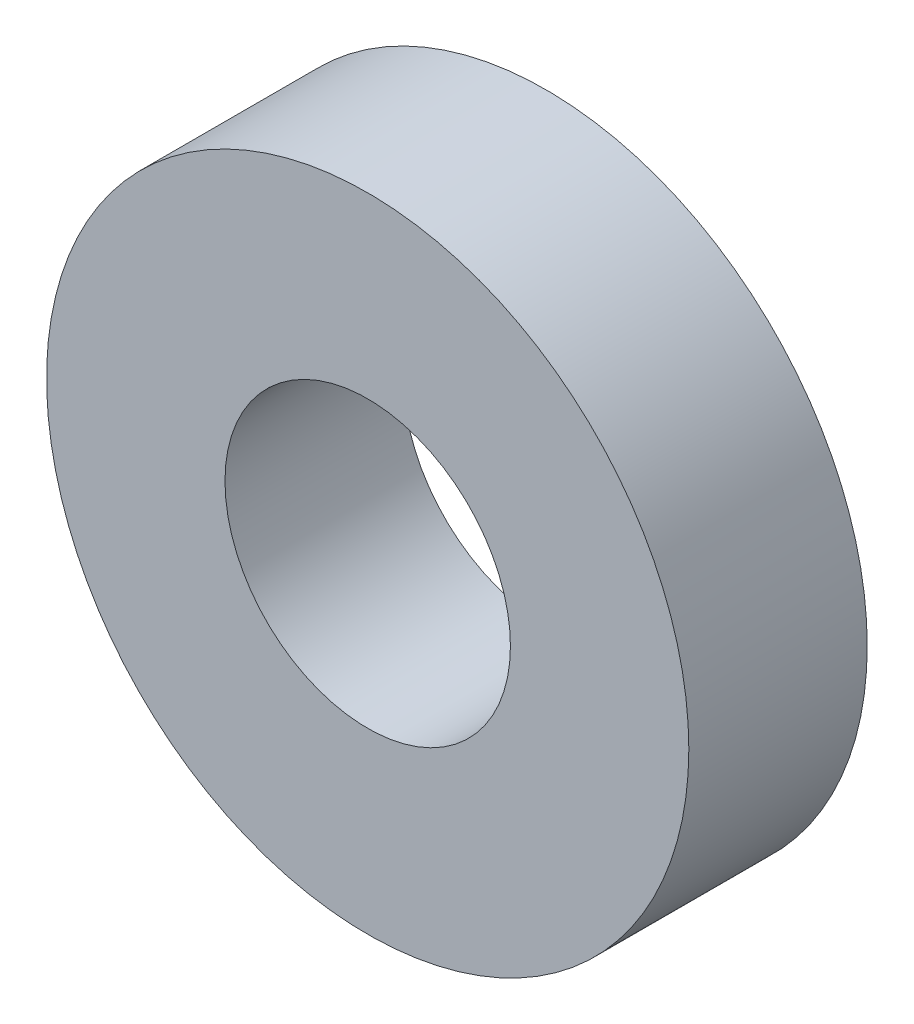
ISO-10303-21;
HEADER;
FILE_DESCRIPTION(('STEP AP214'),'2;1');
FILE_NAME('part.step','',(''),(''),'','','');
FILE_SCHEMA(('AUTOMOTIVE_DESIGN { 1 0 10303 214 1 1 1 1 }'));
ENDSEC;
DATA;
#1=APPLICATION_CONTEXT('core data for automotive mechanical design processes');
#2=APPLICATION_PROTOCOL_DEFINITION('international standard','automotive_design',2000,#1);
#3=PRODUCT_CONTEXT('',#1,'mechanical');
#4=PRODUCT('Part','Part','',(#3));
#5=PRODUCT_RELATED_PRODUCT_CATEGORY('part','',(#4));
#6=PRODUCT_DEFINITION_FORMATION('','',#4);
#7=PRODUCT_DEFINITION_CONTEXT('part definition',#1,'design');
#8=PRODUCT_DEFINITION('design','',#6,#7);
#9=PRODUCT_DEFINITION_SHAPE('','',#8);
#10=(LENGTH_UNIT() NAMED_UNIT(*) SI_UNIT(.MILLI.,.METRE.));
#11=(NAMED_UNIT(*) PLANE_ANGLE_UNIT() SI_UNIT($,.RADIAN.));
#12=(NAMED_UNIT(*) SI_UNIT($,.STERADIAN.) SOLID_ANGLE_UNIT());
#13=UNCERTAINTY_MEASURE_WITH_UNIT(LENGTH_MEASURE(1.E-05),#10,'distance_accuracy_value','');
#14=(GEOMETRIC_REPRESENTATION_CONTEXT(3) GLOBAL_UNCERTAINTY_ASSIGNED_CONTEXT((#13)) GLOBAL_UNIT_ASSIGNED_CONTEXT((#10,
#11,#12)) REPRESENTATION_CONTEXT('',''));
#15=CARTESIAN_POINT('',(0.,0.,0.));
#16=DIRECTION('',(0.,0.,1.));
#17=DIRECTION('',(1.,0.,0.));
#18=AXIS2_PLACEMENT_3D('',#15,#16,#17);
#19=CARTESIAN_POINT('',(0.,0.,7.9375));
#20=DIRECTION('',(0.,0.,1.));
#21=DIRECTION('',(1.,0.,0.));
#22=AXIS2_PLACEMENT_3D('',#19,#20,#21);
#23=PLANE('',#22);
#24=CARTESIAN_POINT('',(0.,0.,7.9375));
#25=DIRECTION('',(0.,0.,1.));
#26=DIRECTION('',(1.,0.,0.));
#27=AXIS2_PLACEMENT_3D('',#24,#25,#26);
#28=CIRCLE('',#27,14.2875);
#29=CARTESIAN_POINT('',(14.2875,0.,7.9375));
#30=VERTEX_POINT('',#29);
#31=EDGE_CURVE('E10',#30,#30,#28,.T.);
#32=ORIENTED_EDGE('',*,*,#31,.T.);
#33=EDGE_LOOP('',(#32));
#34=FACE_BOUND('',#33,.T.);
#35=CARTESIAN_POINT('',(0.,0.,7.9375));
#36=DIRECTION('',(0.,0.,1.));
#37=DIRECTION('',(1.,0.,0.));
#38=AXIS2_PLACEMENT_3D('',#35,#36,#37);
#39=CIRCLE('',#38,6.35);
#40=CARTESIAN_POINT('',(6.35,0.,7.9375));
#41=VERTEX_POINT('',#40);
#42=EDGE_CURVE('E41',#41,#41,#39,.T.);
#43=ORIENTED_EDGE('',*,*,#42,.F.);
#44=EDGE_LOOP('',(#43));
#45=FACE_BOUND('',#44,.T.);
#46=ADVANCED_FACE('F30',(#34,#45),#23,.T.);
#47=CARTESIAN_POINT('',(0.,0.,0.));
#48=DIRECTION('',(0.,0.,1.));
#49=DIRECTION('',(1.,0.,0.));
#50=AXIS2_PLACEMENT_3D('',#47,#48,#49);
#51=PLANE('',#50);
#52=CARTESIAN_POINT('',(0.,0.,0.));
#53=DIRECTION('',(0.,0.,1.));
#54=DIRECTION('',(1.,0.,0.));
#55=AXIS2_PLACEMENT_3D('',#52,#53,#54);
#56=CIRCLE('',#55,14.2875);
#57=CARTESIAN_POINT('',(14.2875,0.,0.));
#58=VERTEX_POINT('',#57);
#59=EDGE_CURVE('E34',#58,#58,#56,.T.);
#60=ORIENTED_EDGE('',*,*,#59,.F.);
#61=EDGE_LOOP('',(#60));
#62=FACE_BOUND('',#61,.T.);
#63=CARTESIAN_POINT('',(0.,0.,0.));
#64=DIRECTION('',(0.,0.,1.));
#65=DIRECTION('',(1.,0.,0.));
#66=AXIS2_PLACEMENT_3D('',#63,#64,#65);
#67=CIRCLE('',#66,6.35);
#68=CARTESIAN_POINT('',(6.35,0.,0.));
#69=VERTEX_POINT('',#68);
#70=EDGE_CURVE('E43',#69,#69,#67,.T.);
#71=ORIENTED_EDGE('',*,*,#70,.T.);
#72=EDGE_LOOP('',(#71));
#73=FACE_BOUND('',#72,.T.);
#74=ADVANCED_FACE('F53',(#62,#73),#51,.F.);
#75=CARTESIAN_POINT('',(0.,0.,7.9375));
#76=DIRECTION('',(0.,0.,-1.));
#77=DIRECTION('',(-1.,0.,0.));
#78=AXIS2_PLACEMENT_3D('',#75,#76,#77);
#79=CYLINDRICAL_SURFACE('',#78,14.2875);
#80=ORIENTED_EDGE('',*,*,#31,.F.);
#81=EDGE_LOOP('',(#80));
#82=FACE_BOUND('',#81,.T.);
#83=ORIENTED_EDGE('',*,*,#59,.T.);
#84=EDGE_LOOP('',(#83));
#85=FACE_BOUND('',#84,.T.);
#86=ADVANCED_FACE('F32',(#82,#85),#79,.T.);
#87=CARTESIAN_POINT('',(0.,0.,7.9375));
#88=DIRECTION('',(0.,0.,-1.));
#89=DIRECTION('',(-1.,0.,0.));
#90=AXIS2_PLACEMENT_3D('',#87,#88,#89);
#91=CYLINDRICAL_SURFACE('',#90,6.35);
#92=ORIENTED_EDGE('',*,*,#42,.T.);
#93=EDGE_LOOP('',(#92));
#94=FACE_BOUND('',#93,.T.);
#95=ORIENTED_EDGE('',*,*,#70,.F.);
#96=EDGE_LOOP('',(#95));
#97=FACE_BOUND('',#96,.T.);
#98=ADVANCED_FACE('F49',(#94,#97),#91,.F.);
#99=CLOSED_SHELL('',(#46,#74,#86,#98));
#100=MANIFOLD_SOLID_BREP('B2',#99);
#101=ADVANCED_BREP_SHAPE_REPRESENTATION('',(#18,#100),#14);
#102=SHAPE_DEFINITION_REPRESENTATION(#9,#101);
ENDSEC;
END-ISO-10303-21;
